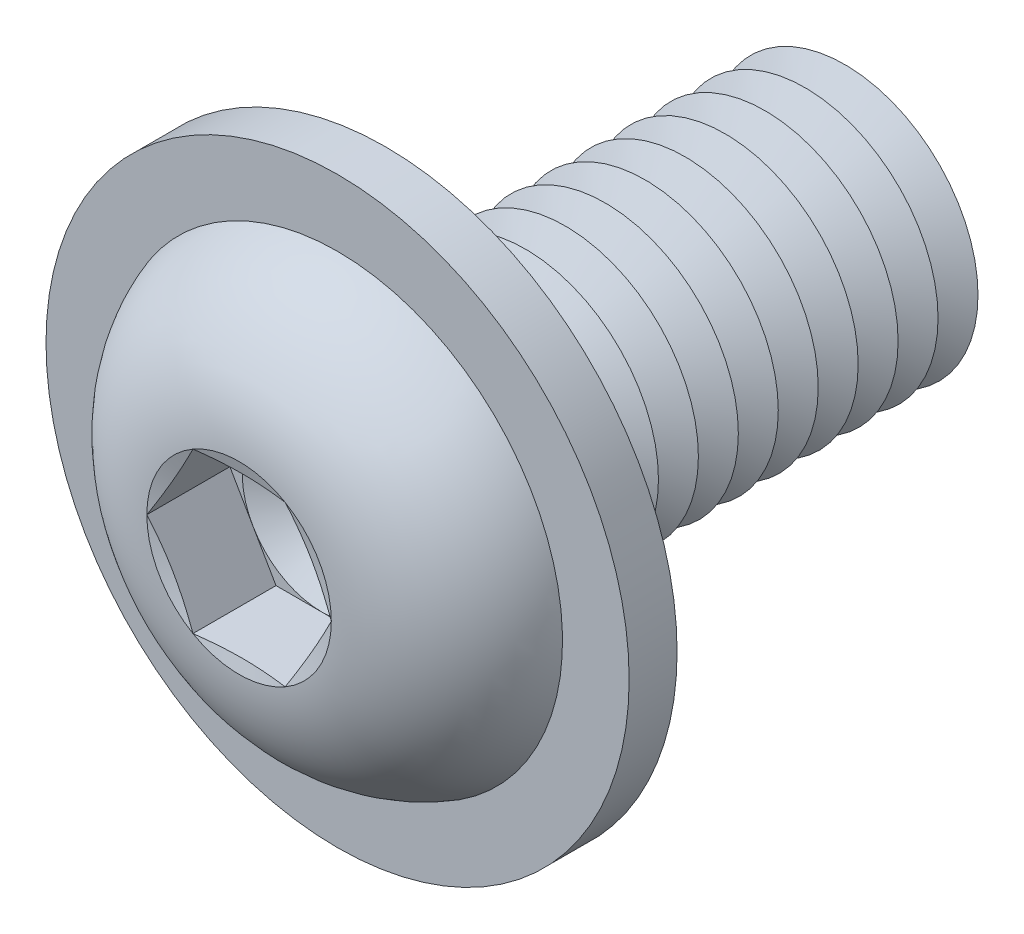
from build123d import *

# Parameters (mm, degrees)
FILLET1_R           = 0.75
LPATTERN1_COUNT     = 12
LPATTERN1_PITCH     = 1.5
CUT_EXTRUDE1_DEPTH  = 3.12
SKETCH5_R           = 10.95
SKETCH5_R_2         = 5.75
BOSS_EXTRUDE1_DEPTH = 1.8


with BuildPart() as part:
    # Sketch1 → Revolve1 (revolve)
    with BuildSketch(Plane(origin=(0, 0, 0), x_dir=(0, 0, -1), z_dir=(1, 0, 0)), mode=Mode.PRIVATE) as revolve1_sk:
        with BuildLine():
            Line((0, 5), (0, 8.75))
            ThreePointArc((0, 8.75), (-3.814142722, 7.21429474), (-5.5, 3.4641))
            Line((-5.5, 3.4641), (-5.035898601, 1.73205))
            Line((-5.035898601, 1.73205), (-5.5, 1.73205))
            Line((-5.5, 1.73205), (-5.5, 0))
            Line((-5.5, 0), (18, 0))
            Line((18, 0), (18, 5))
            Line((18, 5), (0, 5))
        make_face()
    revolve(revolve1_sk.sketch.rotate(Axis((0, 0, -18), (0, 0, 1)), 90), axis=Axis((0, 0, -18), (0, 0, 1)))

    # Fillet1
    fillet1_edges = [part.edges().sort_by_distance(p)[0] for p in [
        (5, 0, 0),
    ]]
    fillet(fillet1_edges, radius=FILLET1_R)

    # Sketch2 → Cut-Revolve1 (revolve, cut)
    with BuildSketch(Plane(origin=(0, 0, 0), x_dir=(0, 0, -1), z_dir=(1, 0, 0)), mode=Mode.PRIVATE) as cut_revolve1_sk:
        Polygon((17.25, 5), (18.75, 5), (18, 3.700961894), align=None)
    cut_revolve1 = revolve(cut_revolve1_sk.sketch.rotate(Axis((0, 0, -18), (0, 0, -1)), 270), axis=Axis((0, 0, -18), (0, 0, -1)), mode=Mode.SUBTRACT)

    # LPattern1: Cut-Revolve1 ×12
    with Locations(*[(0, 0, i * LPATTERN1_PITCH) for i in range(1, LPATTERN1_COUNT)]):
        add(cut_revolve1, mode=Mode.SUBTRACT)

    # Sketch3 → Cut-Extrude1 (cut)
    with BuildSketch(Plane.XY.offset(5.5)):
        Polygon((1.73205, 2.999998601), (-1.73205, 2.999998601), (-3.4641, 0), (-1.73205, -2.999998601), (1.73205, -2.999998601), (3.4641, 0), align=None)
    extrude(amount=-CUT_EXTRUDE1_DEPTH, mode=Mode.SUBTRACT)

    # Cut-Extrude2 cone 1 section (on through the dimple's axis) → Cut-Extrude2 (revolve, cut)
    with BuildSketch(Plane(origin=(0, 0, 2.38), x_dir=(0, -1, 0), z_dir=(1, 0, 0))):
        Polygon((0, 0), (2.999998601, 0), (0, 1.73205), align=None)
    revolve(axis=Axis((0, 0, 2.38), (0, 0, -1)), mode=Mode.SUBTRACT)

    # Sketch5 → Boss-Extrude1 (add)
    with BuildSketch(Plane(origin=(0, 0, 0), x_dir=(-1, 0, 0), z_dir=(0, 0, -1))):
        with Locations(Location((0, 0, 0), (0, 0, 90))):
            Circle(SKETCH5_R)
        Circle(SKETCH5_R_2, mode=Mode.SUBTRACT)
    extrude(amount=-BOSS_EXTRUDE1_DEPTH)


solid = part.part
